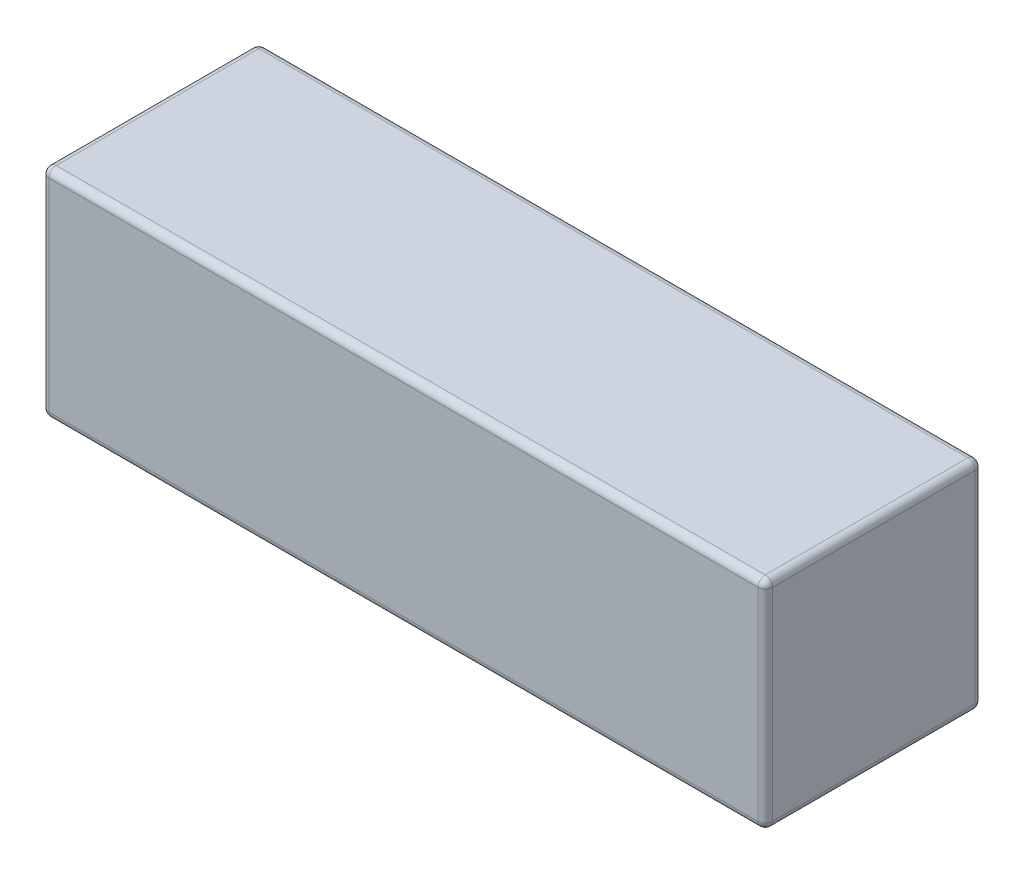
ISO-10303-21;
HEADER;
FILE_DESCRIPTION(('STEP AP214'),'2;1');
FILE_NAME('part.step','',(''),(''),'','','');
FILE_SCHEMA(('AUTOMOTIVE_DESIGN { 1 0 10303 214 1 1 1 1 }'));
ENDSEC;
DATA;
#1=APPLICATION_CONTEXT('core data for automotive mechanical design processes');
#2=APPLICATION_PROTOCOL_DEFINITION('international standard','automotive_design',2000,#1);
#3=PRODUCT_CONTEXT('',#1,'mechanical');
#4=PRODUCT('Part','Part','',(#3));
#5=PRODUCT_RELATED_PRODUCT_CATEGORY('part','',(#4));
#6=PRODUCT_DEFINITION_FORMATION('','',#4);
#7=PRODUCT_DEFINITION_CONTEXT('part definition',#1,'design');
#8=PRODUCT_DEFINITION('design','',#6,#7);
#9=PRODUCT_DEFINITION_SHAPE('','',#8);
#10=(LENGTH_UNIT() NAMED_UNIT(*) SI_UNIT(.MILLI.,.METRE.));
#11=(NAMED_UNIT(*) PLANE_ANGLE_UNIT() SI_UNIT($,.RADIAN.));
#12=(NAMED_UNIT(*) SI_UNIT($,.STERADIAN.) SOLID_ANGLE_UNIT());
#13=UNCERTAINTY_MEASURE_WITH_UNIT(LENGTH_MEASURE(1.E-05),#10,'distance_accuracy_value','');
#14=(GEOMETRIC_REPRESENTATION_CONTEXT(3) GLOBAL_UNCERTAINTY_ASSIGNED_CONTEXT((#13)) GLOBAL_UNIT_ASSIGNED_CONTEXT((#10,
#11,#12)) REPRESENTATION_CONTEXT('',''));
#15=CARTESIAN_POINT('',(0.,0.,0.));
#16=DIRECTION('',(0.,0.,1.));
#17=DIRECTION('',(1.,0.,0.));
#18=AXIS2_PLACEMENT_3D('',#15,#16,#17);
#19=CARTESIAN_POINT('',(50.,-15.,-15.));
#20=DIRECTION('',(0.,0.,1.));
#21=DIRECTION('',(1.,0.,0.));
#22=AXIS2_PLACEMENT_3D('',#19,#20,#21);
#23=PLANE('',#22);
#24=DIRECTION('',(0.,1.,0.));
#25=VECTOR('',#24,1.);
#26=CARTESIAN_POINT('',(49.,-15.,-15.));
#27=LINE('',#26,#25);
#28=CARTESIAN_POINT('',(49.,14.,-15.));
#29=VERTEX_POINT('',#28);
#30=CARTESIAN_POINT('',(49.,-14.,-15.));
#31=VERTEX_POINT('',#30);
#32=EDGE_CURVE('E176',#29,#31,#27,.F.);
#33=ORIENTED_EDGE('',*,*,#32,.T.);
#34=DIRECTION('',(-1.,0.,0.));
#35=VECTOR('',#34,1.);
#36=CARTESIAN_POINT('',(50.,-14.,-15.));
#37=LINE('',#36,#35);
#38=CARTESIAN_POINT('',(-49.,-14.,-15.));
#39=VERTEX_POINT('',#38);
#40=EDGE_CURVE('E180',#31,#39,#37,.T.);
#41=ORIENTED_EDGE('',*,*,#40,.T.);
#42=DIRECTION('',(0.,1.,0.));
#43=VECTOR('',#42,1.);
#44=CARTESIAN_POINT('',(-49.,15.,-15.));
#45=LINE('',#44,#43);
#46=CARTESIAN_POINT('',(-49.,14.,-15.));
#47=VERTEX_POINT('',#46);
#48=EDGE_CURVE('E178',#39,#47,#45,.T.);
#49=ORIENTED_EDGE('',*,*,#48,.T.);
#50=DIRECTION('',(-1.,0.,0.));
#51=VECTOR('',#50,1.);
#52=CARTESIAN_POINT('',(50.,14.,-15.));
#53=LINE('',#52,#51);
#54=EDGE_CURVE('E174',#47,#29,#53,.F.);
#55=ORIENTED_EDGE('',*,*,#54,.T.);
#56=EDGE_LOOP('',(#33,#41,#49,#55));
#57=FACE_BOUND('',#56,.T.);
#58=ADVANCED_FACE('F34',(#57),#23,.F.);
#59=CARTESIAN_POINT('',(50.,15.,15.));
#60=DIRECTION('',(0.,-1.,0.));
#61=DIRECTION('',(0.,0.,-1.));
#62=AXIS2_PLACEMENT_3D('',#59,#60,#61);
#63=PLANE('',#62);
#64=DIRECTION('',(0.,0.,1.));
#65=VECTOR('',#64,1.);
#66=CARTESIAN_POINT('',(49.,15.,15.));
#67=LINE('',#66,#65);
#68=CARTESIAN_POINT('',(49.,15.,14.));
#69=VERTEX_POINT('',#68);
#70=CARTESIAN_POINT('',(49.,15.,-14.));
#71=VERTEX_POINT('',#70);
#72=EDGE_CURVE('E194',#69,#71,#67,.F.);
#73=ORIENTED_EDGE('',*,*,#72,.T.);
#74=DIRECTION('',(-1.,0.,0.));
#75=VECTOR('',#74,1.);
#76=CARTESIAN_POINT('',(50.,15.,-14.));
#77=LINE('',#76,#75);
#78=CARTESIAN_POINT('',(-49.,15.,-14.));
#79=VERTEX_POINT('',#78);
#80=EDGE_CURVE('E196',#71,#79,#77,.T.);
#81=ORIENTED_EDGE('',*,*,#80,.T.);
#82=DIRECTION('',(0.,0.,1.));
#83=VECTOR('',#82,1.);
#84=CARTESIAN_POINT('',(-49.,15.,15.));
#85=LINE('',#84,#83);
#86=CARTESIAN_POINT('',(-49.,15.,14.));
#87=VERTEX_POINT('',#86);
#88=EDGE_CURVE('E192',#79,#87,#85,.T.);
#89=ORIENTED_EDGE('',*,*,#88,.T.);
#90=DIRECTION('',(-1.,0.,0.));
#91=VECTOR('',#90,1.);
#92=CARTESIAN_POINT('',(50.,15.,14.));
#93=LINE('',#92,#91);
#94=EDGE_CURVE('E190',#87,#69,#93,.F.);
#95=ORIENTED_EDGE('',*,*,#94,.T.);
#96=EDGE_LOOP('',(#73,#81,#89,#95));
#97=FACE_BOUND('',#96,.T.);
#98=ADVANCED_FACE('F273',(#97),#63,.F.);
#99=CARTESIAN_POINT('',(50.,-15.,15.));
#100=DIRECTION('',(0.,0.,-1.));
#101=DIRECTION('',(-1.,0.,0.));
#102=AXIS2_PLACEMENT_3D('',#99,#100,#101);
#103=PLANE('',#102);
#104=DIRECTION('',(0.,-1.,0.));
#105=VECTOR('',#104,1.);
#106=CARTESIAN_POINT('',(49.,-15.,15.));
#107=LINE('',#106,#105);
#108=CARTESIAN_POINT('',(49.,-14.,15.));
#109=VERTEX_POINT('',#108);
#110=CARTESIAN_POINT('',(49.,14.,15.));
#111=VERTEX_POINT('',#110);
#112=EDGE_CURVE('E43',#109,#111,#107,.F.);
#113=ORIENTED_EDGE('',*,*,#112,.T.);
#114=DIRECTION('',(-1.,0.,0.));
#115=VECTOR('',#114,1.);
#116=CARTESIAN_POINT('',(50.,14.,15.));
#117=LINE('',#116,#115);
#118=CARTESIAN_POINT('',(-49.,14.,15.));
#119=VERTEX_POINT('',#118);
#120=EDGE_CURVE('E11',#111,#119,#117,.T.);
#121=ORIENTED_EDGE('',*,*,#120,.T.);
#122=DIRECTION('',(0.,-1.,0.));
#123=VECTOR('',#122,1.);
#124=CARTESIAN_POINT('',(-49.,-15.,15.));
#125=LINE('',#124,#123);
#126=CARTESIAN_POINT('',(-49.,-14.,15.));
#127=VERTEX_POINT('',#126);
#128=EDGE_CURVE('E199',#119,#127,#125,.T.);
#129=ORIENTED_EDGE('',*,*,#128,.T.);
#130=DIRECTION('',(-1.,0.,0.));
#131=VECTOR('',#130,1.);
#132=CARTESIAN_POINT('',(50.,-14.,15.));
#133=LINE('',#132,#131);
#134=EDGE_CURVE('E54',#127,#109,#133,.F.);
#135=ORIENTED_EDGE('',*,*,#134,.T.);
#136=EDGE_LOOP('',(#113,#121,#129,#135));
#137=FACE_BOUND('',#136,.T.);
#138=ADVANCED_FACE('F286',(#137),#103,.F.);
#139=CARTESIAN_POINT('',(50.,-15.,15.));
#140=DIRECTION('',(0.,1.,0.));
#141=DIRECTION('',(0.,0.,1.));
#142=AXIS2_PLACEMENT_3D('',#139,#140,#141);
#143=PLANE('',#142);
#144=DIRECTION('',(-1.,0.,0.));
#145=VECTOR('',#144,1.);
#146=CARTESIAN_POINT('',(50.,-15.,14.));
#147=LINE('',#146,#145);
#148=CARTESIAN_POINT('',(49.,-15.,14.));
#149=VERTEX_POINT('',#148);
#150=CARTESIAN_POINT('',(-49.,-15.,14.));
#151=VERTEX_POINT('',#150);
#152=EDGE_CURVE('E126',#149,#151,#147,.T.);
#153=ORIENTED_EDGE('',*,*,#152,.T.);
#154=DIRECTION('',(0.,0.,-1.));
#155=VECTOR('',#154,1.);
#156=CARTESIAN_POINT('',(-49.,-15.,-15.));
#157=LINE('',#156,#155);
#158=CARTESIAN_POINT('',(-49.,-15.,-14.));
#159=VERTEX_POINT('',#158);
#160=EDGE_CURVE('E163',#151,#159,#157,.T.);
#161=ORIENTED_EDGE('',*,*,#160,.T.);
#162=DIRECTION('',(-1.,0.,0.));
#163=VECTOR('',#162,1.);
#164=CARTESIAN_POINT('',(50.,-15.,-14.));
#165=LINE('',#164,#163);
#166=CARTESIAN_POINT('',(49.,-15.,-14.));
#167=VERTEX_POINT('',#166);
#168=EDGE_CURVE('E129',#159,#167,#165,.F.);
#169=ORIENTED_EDGE('',*,*,#168,.T.);
#170=DIRECTION('',(0.,0.,-1.));
#171=VECTOR('',#170,1.);
#172=CARTESIAN_POINT('',(49.,-15.,15.));
#173=LINE('',#172,#171);
#174=EDGE_CURVE('E121',#167,#149,#173,.F.);
#175=ORIENTED_EDGE('',*,*,#174,.T.);
#176=EDGE_LOOP('',(#153,#161,#169,#175));
#177=FACE_BOUND('',#176,.T.);
#178=ADVANCED_FACE('F123',(#177),#143,.F.);
#179=CARTESIAN_POINT('',(50.,0.,0.));
#180=DIRECTION('',(-1.,0.,0.));
#181=DIRECTION('',(0.,0.,1.));
#182=AXIS2_PLACEMENT_3D('',#179,#180,#181);
#183=PLANE('',#182);
#184=DIRECTION('',(0.,-1.,0.));
#185=VECTOR('',#184,1.);
#186=CARTESIAN_POINT('',(50.,0.,14.));
#187=LINE('',#186,#185);
#188=CARTESIAN_POINT('',(50.,14.,14.));
#189=VERTEX_POINT('',#188);
#190=CARTESIAN_POINT('',(50.,-14.,14.));
#191=VERTEX_POINT('',#190);
#192=EDGE_CURVE('E183',#189,#191,#187,.T.);
#193=ORIENTED_EDGE('',*,*,#192,.T.);
#194=DIRECTION('',(0.,0.,-1.));
#195=VECTOR('',#194,1.);
#196=CARTESIAN_POINT('',(50.,-14.,0.));
#197=LINE('',#196,#195);
#198=CARTESIAN_POINT('',(50.,-14.,-14.));
#199=VERTEX_POINT('',#198);
#200=EDGE_CURVE('E140',#191,#199,#197,.T.);
#201=ORIENTED_EDGE('',*,*,#200,.T.);
#202=DIRECTION('',(0.,1.,0.));
#203=VECTOR('',#202,1.);
#204=CARTESIAN_POINT('',(50.,0.,-14.));
#205=LINE('',#204,#203);
#206=CARTESIAN_POINT('',(50.,14.,-14.));
#207=VERTEX_POINT('',#206);
#208=EDGE_CURVE('E187',#199,#207,#205,.T.);
#209=ORIENTED_EDGE('',*,*,#208,.T.);
#210=DIRECTION('',(0.,0.,1.));
#211=VECTOR('',#210,1.);
#212=CARTESIAN_POINT('',(50.,14.,0.));
#213=LINE('',#212,#211);
#214=EDGE_CURVE('E185',#207,#189,#213,.T.);
#215=ORIENTED_EDGE('',*,*,#214,.T.);
#216=EDGE_LOOP('',(#193,#201,#209,#215));
#217=FACE_BOUND('',#216,.T.);
#218=ADVANCED_FACE('F478',(#217),#183,.F.);
#219=CARTESIAN_POINT('',(-50.,0.,0.));
#220=DIRECTION('',(-1.,0.,0.));
#221=DIRECTION('',(0.,0.,1.));
#222=AXIS2_PLACEMENT_3D('',#219,#220,#221);
#223=PLANE('',#222);
#224=DIRECTION('',(0.,1.,0.));
#225=VECTOR('',#224,1.);
#226=CARTESIAN_POINT('',(-50.,-15.,-14.));
#227=LINE('',#226,#225);
#228=CARTESIAN_POINT('',(-50.,14.,-14.));
#229=VERTEX_POINT('',#228);
#230=CARTESIAN_POINT('',(-50.,-14.,-14.));
#231=VERTEX_POINT('',#230);
#232=EDGE_CURVE('E169',#229,#231,#227,.F.);
#233=ORIENTED_EDGE('',*,*,#232,.T.);
#234=DIRECTION('',(0.,0.,-1.));
#235=VECTOR('',#234,1.);
#236=CARTESIAN_POINT('',(-50.,-14.,15.));
#237=LINE('',#236,#235);
#238=CARTESIAN_POINT('',(-50.,-14.,14.));
#239=VERTEX_POINT('',#238);
#240=EDGE_CURVE('E171',#231,#239,#237,.F.);
#241=ORIENTED_EDGE('',*,*,#240,.T.);
#242=DIRECTION('',(0.,-1.,0.));
#243=VECTOR('',#242,1.);
#244=CARTESIAN_POINT('',(-50.,15.,14.));
#245=LINE('',#244,#243);
#246=CARTESIAN_POINT('',(-50.,14.,14.));
#247=VERTEX_POINT('',#246);
#248=EDGE_CURVE('E165',#239,#247,#245,.F.);
#249=ORIENTED_EDGE('',*,*,#248,.T.);
#250=DIRECTION('',(0.,0.,1.));
#251=VECTOR('',#250,1.);
#252=CARTESIAN_POINT('',(-50.,14.,-15.));
#253=LINE('',#252,#251);
#254=EDGE_CURVE('E167',#247,#229,#253,.F.);
#255=ORIENTED_EDGE('',*,*,#254,.T.);
#256=EDGE_LOOP('',(#233,#241,#249,#255));
#257=FACE_BOUND('',#256,.T.);
#258=ADVANCED_FACE('F471',(#257),#223,.T.);
#259=CARTESIAN_POINT('',(49.,14.,0.));
#260=DIRECTION('',(0.,0.,1.));
#261=DIRECTION('',(1.,0.,0.));
#262=AXIS2_PLACEMENT_3D('',#259,#260,#261);
#263=CYLINDRICAL_SURFACE('',#262,1.);
#264=CARTESIAN_POINT('',(49.,14.,14.));
#265=DIRECTION('',(0.,0.,1.));
#266=DIRECTION('',(1.,0.,0.));
#267=AXIS2_PLACEMENT_3D('',#264,#265,#266);
#268=CIRCLE('',#267,1.);
#269=EDGE_CURVE('E38',#189,#69,#268,.T.);
#270=ORIENTED_EDGE('',*,*,#269,.F.);
#271=ORIENTED_EDGE('',*,*,#214,.F.);
#272=CARTESIAN_POINT('',(49.,14.,-14.));
#273=DIRECTION('',(0.,0.,-1.));
#274=DIRECTION('',(-1.,0.,0.));
#275=AXIS2_PLACEMENT_3D('',#272,#273,#274);
#276=CIRCLE('',#275,1.);
#277=EDGE_CURVE('E160',#71,#207,#276,.T.);
#278=ORIENTED_EDGE('',*,*,#277,.F.);
#279=ORIENTED_EDGE('',*,*,#72,.F.);
#280=EDGE_LOOP('',(#270,#271,#278,#279));
#281=FACE_BOUND('',#280,.T.);
#282=ADVANCED_FACE('F36',(#281),#263,.T.);
#283=CARTESIAN_POINT('',(49.,14.,14.));
#284=DIRECTION('',(0.,1.,0.));
#285=DIRECTION('',(0.,0.,1.));
#286=AXIS2_PLACEMENT_3D('',#283,#284,#285);
#287=SPHERICAL_SURFACE('',#286,1.);
#288=CARTESIAN_POINT('',(49.,14.,14.));
#289=DIRECTION('',(0.,1.,0.));
#290=DIRECTION('',(0.,0.,1.));
#291=AXIS2_PLACEMENT_3D('',#288,#289,#290);
#292=CIRCLE('',#291,1.);
#293=EDGE_CURVE('E244',#189,#111,#292,.F.);
#294=ORIENTED_EDGE('',*,*,#293,.F.);
#295=ORIENTED_EDGE('',*,*,#269,.T.);
#296=CARTESIAN_POINT('',(49.,14.,14.));
#297=DIRECTION('',(1.,0.,0.));
#298=DIRECTION('',(0.,0.,-1.));
#299=AXIS2_PLACEMENT_3D('',#296,#297,#298);
#300=CIRCLE('',#299,1.);
#301=EDGE_CURVE('E246',#111,#69,#300,.F.);
#302=ORIENTED_EDGE('',*,*,#301,.F.);
#303=EDGE_LOOP('',(#294,#295,#302));
#304=FACE_BOUND('',#303,.T.);
#305=ADVANCED_FACE('F279',(#304),#287,.T.);
#306=CARTESIAN_POINT('',(49.,14.,-14.));
#307=DIRECTION('',(1.,0.,0.));
#308=DIRECTION('',(0.,0.,-1.));
#309=AXIS2_PLACEMENT_3D('',#306,#307,#308);
#310=SPHERICAL_SURFACE('',#309,1.);
#311=CARTESIAN_POINT('',(49.,14.,-14.));
#312=DIRECTION('',(1.,0.,0.));
#313=DIRECTION('',(0.,0.,-1.));
#314=AXIS2_PLACEMENT_3D('',#311,#312,#313);
#315=CIRCLE('',#314,1.);
#316=EDGE_CURVE('E238',#71,#29,#315,.F.);
#317=ORIENTED_EDGE('',*,*,#316,.F.);
#318=ORIENTED_EDGE('',*,*,#277,.T.);
#319=CARTESIAN_POINT('',(49.,14.,-14.));
#320=DIRECTION('',(0.,1.,0.));
#321=DIRECTION('',(0.,0.,1.));
#322=AXIS2_PLACEMENT_3D('',#319,#320,#321);
#323=CIRCLE('',#322,1.);
#324=EDGE_CURVE('E241',#29,#207,#323,.F.);
#325=ORIENTED_EDGE('',*,*,#324,.F.);
#326=EDGE_LOOP('',(#317,#318,#325));
#327=FACE_BOUND('',#326,.T.);
#328=ADVANCED_FACE('F253',(#327),#310,.T.);
#329=CARTESIAN_POINT('',(50.,14.,14.));
#330=DIRECTION('',(-1.,0.,0.));
#331=DIRECTION('',(0.,0.,1.));
#332=AXIS2_PLACEMENT_3D('',#329,#330,#331);
#333=CYLINDRICAL_SURFACE('',#332,1.);
#334=ORIENTED_EDGE('',*,*,#301,.T.);
#335=ORIENTED_EDGE('',*,*,#94,.F.);
#336=CARTESIAN_POINT('',(-49.,14.,14.));
#337=DIRECTION('',(-1.,0.,0.));
#338=DIRECTION('',(0.,0.,1.));
#339=AXIS2_PLACEMENT_3D('',#336,#337,#338);
#340=CIRCLE('',#339,1.);
#341=EDGE_CURVE('E232',#119,#87,#340,.T.);
#342=ORIENTED_EDGE('',*,*,#341,.F.);
#343=ORIENTED_EDGE('',*,*,#120,.F.);
#344=EDGE_LOOP('',(#334,#335,#342,#343));
#345=FACE_BOUND('',#344,.T.);
#346=ADVANCED_FACE('F283',(#345),#333,.T.);
#347=CARTESIAN_POINT('',(49.,0.,14.));
#348=DIRECTION('',(0.,-1.,0.));
#349=DIRECTION('',(0.,0.,-1.));
#350=AXIS2_PLACEMENT_3D('',#347,#348,#349);
#351=CYLINDRICAL_SURFACE('',#350,1.);
#352=ORIENTED_EDGE('',*,*,#293,.T.);
#353=ORIENTED_EDGE('',*,*,#112,.F.);
#354=CARTESIAN_POINT('',(49.,-14.,14.));
#355=DIRECTION('',(0.,-1.,0.));
#356=DIRECTION('',(0.,0.,-1.));
#357=AXIS2_PLACEMENT_3D('',#354,#355,#356);
#358=CIRCLE('',#357,1.);
#359=EDGE_CURVE('E144',#191,#109,#358,.T.);
#360=ORIENTED_EDGE('',*,*,#359,.F.);
#361=ORIENTED_EDGE('',*,*,#192,.F.);
#362=EDGE_LOOP('',(#352,#353,#360,#361));
#363=FACE_BOUND('',#362,.T.);
#364=ADVANCED_FACE('F435',(#363),#351,.T.);
#365=CARTESIAN_POINT('',(49.,-14.,0.));
#366=DIRECTION('',(0.,0.,-1.));
#367=DIRECTION('',(0.,1.,0.));
#368=AXIS2_PLACEMENT_3D('',#365,#366,#367);
#369=CYLINDRICAL_SURFACE('',#368,1.);
#370=CARTESIAN_POINT('',(49.,-14.,-14.));
#371=DIRECTION('',(0.,0.,-1.));
#372=DIRECTION('',(-1.,0.,0.));
#373=AXIS2_PLACEMENT_3D('',#370,#371,#372);
#374=CIRCLE('',#373,1.);
#375=EDGE_CURVE('E145',#199,#167,#374,.T.);
#376=ORIENTED_EDGE('',*,*,#375,.F.);
#377=ORIENTED_EDGE('',*,*,#200,.F.);
#378=CARTESIAN_POINT('',(49.,-14.,14.));
#379=DIRECTION('',(0.,0.,1.));
#380=DIRECTION('',(1.,0.,0.));
#381=AXIS2_PLACEMENT_3D('',#378,#379,#380);
#382=CIRCLE('',#381,1.);
#383=EDGE_CURVE('E136',#149,#191,#382,.T.);
#384=ORIENTED_EDGE('',*,*,#383,.F.);
#385=ORIENTED_EDGE('',*,*,#174,.F.);
#386=EDGE_LOOP('',(#376,#377,#384,#385));
#387=FACE_BOUND('',#386,.T.);
#388=ADVANCED_FACE('F138',(#387),#369,.T.);
#389=CARTESIAN_POINT('',(49.,0.,-14.));
#390=DIRECTION('',(0.,1.,0.));
#391=DIRECTION('',(0.,0.,1.));
#392=AXIS2_PLACEMENT_3D('',#389,#390,#391);
#393=CYLINDRICAL_SURFACE('',#392,1.);
#394=ORIENTED_EDGE('',*,*,#324,.T.);
#395=ORIENTED_EDGE('',*,*,#208,.F.);
#396=CARTESIAN_POINT('',(49.,-14.,-14.));
#397=DIRECTION('',(0.,-1.,0.));
#398=DIRECTION('',(0.,0.,-1.));
#399=AXIS2_PLACEMENT_3D('',#396,#397,#398);
#400=CIRCLE('',#399,1.);
#401=EDGE_CURVE('E228',#31,#199,#400,.T.);
#402=ORIENTED_EDGE('',*,*,#401,.F.);
#403=ORIENTED_EDGE('',*,*,#32,.F.);
#404=EDGE_LOOP('',(#394,#395,#402,#403));
#405=FACE_BOUND('',#404,.T.);
#406=ADVANCED_FACE('F261',(#405),#393,.T.);
#407=CARTESIAN_POINT('',(50.,14.,-14.));
#408=DIRECTION('',(-1.,0.,0.));
#409=DIRECTION('',(0.,0.,1.));
#410=AXIS2_PLACEMENT_3D('',#407,#408,#409);
#411=CYLINDRICAL_SURFACE('',#410,1.);
#412=ORIENTED_EDGE('',*,*,#316,.T.);
#413=ORIENTED_EDGE('',*,*,#54,.F.);
#414=CARTESIAN_POINT('',(-49.,14.,-14.));
#415=DIRECTION('',(-1.,0.,0.));
#416=DIRECTION('',(0.,0.,1.));
#417=AXIS2_PLACEMENT_3D('',#414,#415,#416);
#418=CIRCLE('',#417,1.);
#419=EDGE_CURVE('E225',#79,#47,#418,.T.);
#420=ORIENTED_EDGE('',*,*,#419,.F.);
#421=ORIENTED_EDGE('',*,*,#80,.F.);
#422=EDGE_LOOP('',(#412,#413,#420,#421));
#423=FACE_BOUND('',#422,.T.);
#424=ADVANCED_FACE('F270',(#423),#411,.T.);
#425=CARTESIAN_POINT('',(-49.,14.,15.));
#426=DIRECTION('',(0.,0.,-1.));
#427=DIRECTION('',(-1.,0.,0.));
#428=AXIS2_PLACEMENT_3D('',#425,#426,#427);
#429=CYLINDRICAL_SURFACE('',#428,1.);
#430=CARTESIAN_POINT('',(-49.,14.,14.));
#431=DIRECTION('',(0.,0.,1.));
#432=DIRECTION('',(1.,0.,0.));
#433=AXIS2_PLACEMENT_3D('',#430,#431,#432);
#434=CIRCLE('',#433,1.);
#435=EDGE_CURVE('E235',#87,#247,#434,.T.);
#436=ORIENTED_EDGE('',*,*,#435,.F.);
#437=ORIENTED_EDGE('',*,*,#88,.F.);
#438=CARTESIAN_POINT('',(-49.,14.,-14.));
#439=DIRECTION('',(0.,0.,-1.));
#440=DIRECTION('',(0.,1.,0.));
#441=AXIS2_PLACEMENT_3D('',#438,#439,#440);
#442=CIRCLE('',#441,1.);
#443=EDGE_CURVE('E223',#229,#79,#442,.T.);
#444=ORIENTED_EDGE('',*,*,#443,.F.);
#445=ORIENTED_EDGE('',*,*,#254,.F.);
#446=EDGE_LOOP('',(#436,#437,#444,#445));
#447=FACE_BOUND('',#446,.T.);
#448=ADVANCED_FACE('F404',(#447),#429,.T.);
#449=CARTESIAN_POINT('',(-49.,14.,14.));
#450=DIRECTION('',(0.,1.,0.));
#451=DIRECTION('',(0.,0.,1.));
#452=AXIS2_PLACEMENT_3D('',#449,#450,#451);
#453=SPHERICAL_SURFACE('',#452,1.);
#454=ORIENTED_EDGE('',*,*,#341,.T.);
#455=ORIENTED_EDGE('',*,*,#435,.T.);
#456=CARTESIAN_POINT('',(-49.,14.,14.));
#457=DIRECTION('',(0.,1.,0.));
#458=DIRECTION('',(0.,0.,1.));
#459=AXIS2_PLACEMENT_3D('',#456,#457,#458);
#460=CIRCLE('',#459,1.);
#461=EDGE_CURVE('E151',#119,#247,#460,.F.);
#462=ORIENTED_EDGE('',*,*,#461,.F.);
#463=EDGE_LOOP('',(#454,#455,#462));
#464=FACE_BOUND('',#463,.T.);
#465=ADVANCED_FACE('F316',(#464),#453,.T.);
#466=CARTESIAN_POINT('',(49.,-14.,14.));
#467=DIRECTION('',(1.,0.,0.));
#468=DIRECTION('',(0.,0.,-1.));
#469=AXIS2_PLACEMENT_3D('',#466,#467,#468);
#470=SPHERICAL_SURFACE('',#469,1.);
#471=ORIENTED_EDGE('',*,*,#383,.T.);
#472=ORIENTED_EDGE('',*,*,#359,.T.);
#473=CARTESIAN_POINT('',(49.,-14.,14.));
#474=DIRECTION('',(1.,0.,0.));
#475=DIRECTION('',(0.,0.,-1.));
#476=AXIS2_PLACEMENT_3D('',#473,#474,#475);
#477=CIRCLE('',#476,1.);
#478=EDGE_CURVE('E148',#149,#109,#477,.F.);
#479=ORIENTED_EDGE('',*,*,#478,.F.);
#480=EDGE_LOOP('',(#471,#472,#479));
#481=FACE_BOUND('',#480,.T.);
#482=ADVANCED_FACE('F149',(#481),#470,.T.);
#483=CARTESIAN_POINT('',(49.,-14.,-14.));
#484=DIRECTION('',(1.,0.,0.));
#485=DIRECTION('',(0.,0.,-1.));
#486=AXIS2_PLACEMENT_3D('',#483,#484,#485);
#487=SPHERICAL_SURFACE('',#486,1.);
#488=ORIENTED_EDGE('',*,*,#401,.T.);
#489=ORIENTED_EDGE('',*,*,#375,.T.);
#490=CARTESIAN_POINT('',(49.,-14.,-14.));
#491=DIRECTION('',(1.,0.,0.));
#492=DIRECTION('',(0.,0.,-1.));
#493=AXIS2_PLACEMENT_3D('',#490,#491,#492);
#494=CIRCLE('',#493,1.);
#495=EDGE_CURVE('E152',#31,#167,#494,.F.);
#496=ORIENTED_EDGE('',*,*,#495,.F.);
#497=EDGE_LOOP('',(#488,#489,#496));
#498=FACE_BOUND('',#497,.T.);
#499=ADVANCED_FACE('F306',(#498),#487,.T.);
#500=CARTESIAN_POINT('',(-49.,14.,-14.));
#501=DIRECTION('',(0.,1.,0.));
#502=DIRECTION('',(0.,0.,1.));
#503=AXIS2_PLACEMENT_3D('',#500,#501,#502);
#504=SPHERICAL_SURFACE('',#503,1.);
#505=ORIENTED_EDGE('',*,*,#443,.T.);
#506=ORIENTED_EDGE('',*,*,#419,.T.);
#507=CARTESIAN_POINT('',(-49.,14.,-14.));
#508=DIRECTION('',(0.,1.,0.));
#509=DIRECTION('',(0.,0.,1.));
#510=AXIS2_PLACEMENT_3D('',#507,#508,#509);
#511=CIRCLE('',#510,1.);
#512=EDGE_CURVE('E216',#229,#47,#511,.F.);
#513=ORIENTED_EDGE('',*,*,#512,.F.);
#514=EDGE_LOOP('',(#505,#506,#513));
#515=FACE_BOUND('',#514,.T.);
#516=ADVANCED_FACE('F308',(#515),#504,.T.);
#517=CARTESIAN_POINT('',(-49.,-15.,14.));
#518=DIRECTION('',(0.,1.,0.));
#519=DIRECTION('',(0.,0.,1.));
#520=AXIS2_PLACEMENT_3D('',#517,#518,#519);
#521=CYLINDRICAL_SURFACE('',#520,1.);
#522=ORIENTED_EDGE('',*,*,#461,.T.);
#523=ORIENTED_EDGE('',*,*,#248,.F.);
#524=CARTESIAN_POINT('',(-49.,-14.,14.));
#525=DIRECTION('',(0.,-1.,0.));
#526=DIRECTION('',(0.,0.,-1.));
#527=AXIS2_PLACEMENT_3D('',#524,#525,#526);
#528=CIRCLE('',#527,1.);
#529=EDGE_CURVE('E213',#127,#239,#528,.T.);
#530=ORIENTED_EDGE('',*,*,#529,.F.);
#531=ORIENTED_EDGE('',*,*,#128,.F.);
#532=EDGE_LOOP('',(#522,#523,#530,#531));
#533=FACE_BOUND('',#532,.T.);
#534=ADVANCED_FACE('F291',(#533),#521,.T.);
#535=CARTESIAN_POINT('',(50.,-14.,14.));
#536=DIRECTION('',(-1.,0.,0.));
#537=DIRECTION('',(0.,0.,1.));
#538=AXIS2_PLACEMENT_3D('',#535,#536,#537);
#539=CYLINDRICAL_SURFACE('',#538,1.);
#540=ORIENTED_EDGE('',*,*,#478,.T.);
#541=ORIENTED_EDGE('',*,*,#134,.F.);
#542=CARTESIAN_POINT('',(-49.,-14.,14.));
#543=DIRECTION('',(-1.,0.,0.));
#544=DIRECTION('',(0.,0.,1.));
#545=AXIS2_PLACEMENT_3D('',#542,#543,#544);
#546=CIRCLE('',#545,1.);
#547=EDGE_CURVE('E156',#151,#127,#546,.T.);
#548=ORIENTED_EDGE('',*,*,#547,.F.);
#549=ORIENTED_EDGE('',*,*,#152,.F.);
#550=EDGE_LOOP('',(#540,#541,#548,#549));
#551=FACE_BOUND('',#550,.T.);
#552=ADVANCED_FACE('F154',(#551),#539,.T.);
#553=CARTESIAN_POINT('',(50.,-14.,-14.));
#554=DIRECTION('',(-1.,0.,0.));
#555=DIRECTION('',(0.,0.,1.));
#556=AXIS2_PLACEMENT_3D('',#553,#554,#555);
#557=CYLINDRICAL_SURFACE('',#556,1.);
#558=ORIENTED_EDGE('',*,*,#495,.T.);
#559=ORIENTED_EDGE('',*,*,#168,.F.);
#560=CARTESIAN_POINT('',(-49.,-14.,-14.));
#561=DIRECTION('',(-1.,0.,0.));
#562=DIRECTION('',(0.,0.,1.));
#563=AXIS2_PLACEMENT_3D('',#560,#561,#562);
#564=CIRCLE('',#563,1.);
#565=EDGE_CURVE('E209',#39,#159,#564,.T.);
#566=ORIENTED_EDGE('',*,*,#565,.F.);
#567=ORIENTED_EDGE('',*,*,#40,.F.);
#568=EDGE_LOOP('',(#558,#559,#566,#567));
#569=FACE_BOUND('',#568,.T.);
#570=ADVANCED_FACE('F304',(#569),#557,.T.);
#571=CARTESIAN_POINT('',(-49.,-15.,-14.));
#572=DIRECTION('',(0.,-1.,0.));
#573=DIRECTION('',(0.,0.,-1.));
#574=AXIS2_PLACEMENT_3D('',#571,#572,#573);
#575=CYLINDRICAL_SURFACE('',#574,1.);
#576=ORIENTED_EDGE('',*,*,#512,.T.);
#577=ORIENTED_EDGE('',*,*,#48,.F.);
#578=CARTESIAN_POINT('',(-49.,-14.,-14.));
#579=DIRECTION('',(0.,-1.,0.));
#580=DIRECTION('',(0.,0.,-1.));
#581=AXIS2_PLACEMENT_3D('',#578,#579,#580);
#582=CIRCLE('',#581,1.);
#583=EDGE_CURVE('E207',#231,#39,#582,.T.);
#584=ORIENTED_EDGE('',*,*,#583,.F.);
#585=ORIENTED_EDGE('',*,*,#232,.F.);
#586=EDGE_LOOP('',(#576,#577,#584,#585));
#587=FACE_BOUND('',#586,.T.);
#588=ADVANCED_FACE('F332',(#587),#575,.T.);
#589=CARTESIAN_POINT('',(-49.,-14.,14.));
#590=DIRECTION('',(0.,0.,1.));
#591=DIRECTION('',(1.,0.,0.));
#592=AXIS2_PLACEMENT_3D('',#589,#590,#591);
#593=SPHERICAL_SURFACE('',#592,1.);
#594=ORIENTED_EDGE('',*,*,#547,.T.);
#595=ORIENTED_EDGE('',*,*,#529,.T.);
#596=CARTESIAN_POINT('',(-49.,-14.,14.));
#597=DIRECTION('',(0.,0.,1.));
#598=DIRECTION('',(1.,0.,0.));
#599=AXIS2_PLACEMENT_3D('',#596,#597,#598);
#600=CIRCLE('',#599,1.);
#601=EDGE_CURVE('E205',#151,#239,#600,.F.);
#602=ORIENTED_EDGE('',*,*,#601,.F.);
#603=EDGE_LOOP('',(#594,#595,#602));
#604=FACE_BOUND('',#603,.T.);
#605=ADVANCED_FACE('F293',(#604),#593,.T.);
#606=CARTESIAN_POINT('',(-49.,-14.,-14.));
#607=DIRECTION('',(0.,0.,-1.));
#608=DIRECTION('',(-1.,0.,0.));
#609=AXIS2_PLACEMENT_3D('',#606,#607,#608);
#610=SPHERICAL_SURFACE('',#609,1.);
#611=ORIENTED_EDGE('',*,*,#583,.T.);
#612=ORIENTED_EDGE('',*,*,#565,.T.);
#613=CARTESIAN_POINT('',(-49.,-14.,-14.));
#614=DIRECTION('',(0.,0.,-1.));
#615=DIRECTION('',(-1.,0.,0.));
#616=AXIS2_PLACEMENT_3D('',#613,#614,#615);
#617=CIRCLE('',#616,1.);
#618=EDGE_CURVE('E203',#231,#159,#617,.F.);
#619=ORIENTED_EDGE('',*,*,#618,.F.);
#620=EDGE_LOOP('',(#611,#612,#619));
#621=FACE_BOUND('',#620,.T.);
#622=ADVANCED_FACE('F301',(#621),#610,.T.);
#623=CARTESIAN_POINT('',(-49.,-14.,15.));
#624=DIRECTION('',(0.,0.,1.));
#625=DIRECTION('',(0.,-1.,0.));
#626=AXIS2_PLACEMENT_3D('',#623,#624,#625);
#627=CYLINDRICAL_SURFACE('',#626,1.);
#628=ORIENTED_EDGE('',*,*,#601,.T.);
#629=ORIENTED_EDGE('',*,*,#240,.F.);
#630=ORIENTED_EDGE('',*,*,#618,.T.);
#631=ORIENTED_EDGE('',*,*,#160,.F.);
#632=EDGE_LOOP('',(#628,#629,#630,#631));
#633=FACE_BOUND('',#632,.T.);
#634=ADVANCED_FACE('F297',(#633),#627,.T.);
#635=CLOSED_SHELL('',(#58,#98,#138,#178,#218,#258,#282,#305,#328,#346,#364,#388,#406,#424,#448,
#465,#482,#499,#516,#534,#552,#570,#588,#605,#622,#634));
#636=MANIFOLD_SOLID_BREP('B2',#635);
#637=ADVANCED_BREP_SHAPE_REPRESENTATION('',(#18,#636),#14);
#638=SHAPE_DEFINITION_REPRESENTATION(#9,#637);
ENDSEC;
END-ISO-10303-21;
